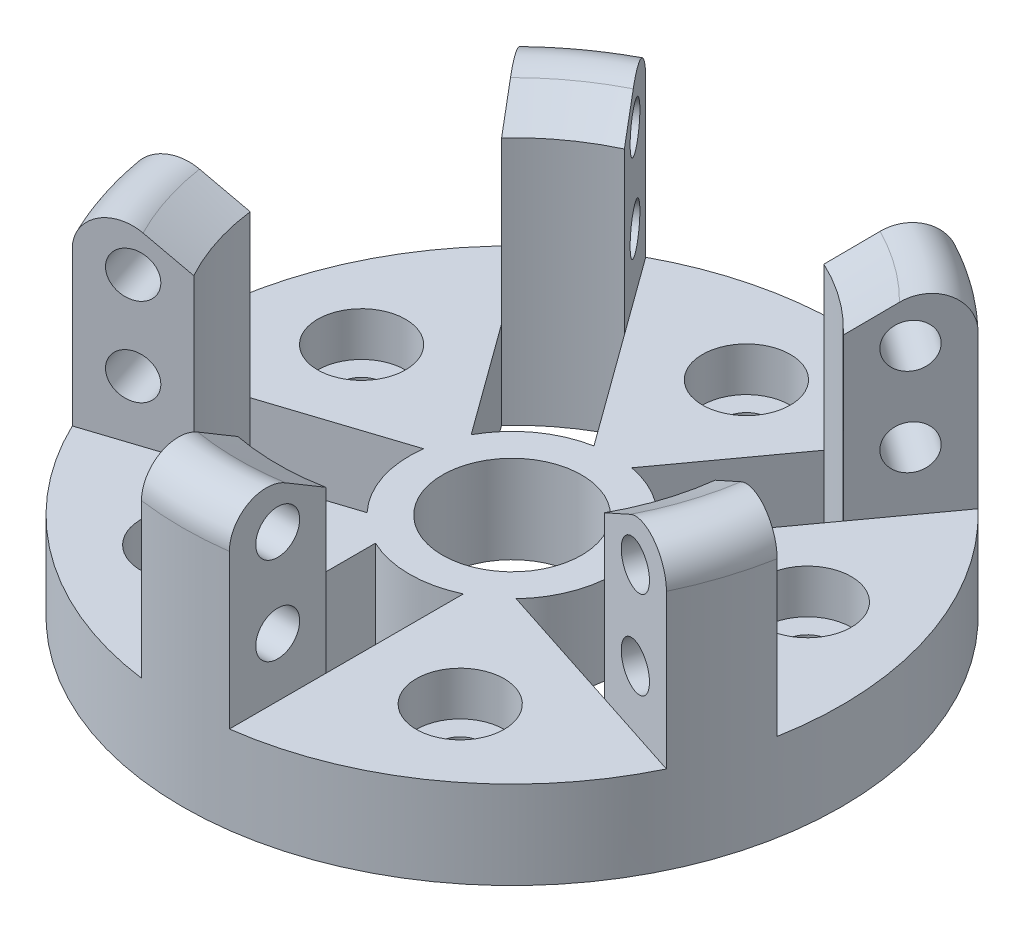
from build123d import *

# Parameters (mm, degrees)
CUT_EXTRUDE_2_DEPTH      = 69.745909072
CUT_EXTRUDE_START        = 12
SKETCH_3_R               = 6
CUT_EXTRUDE_3_DEPTH      = 6
SKETCH_3_3_R             = 3
CUT_EXTRUDE_4_DEPTH      = 87.121521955
PATTERN_CIRCULAR_1_COUNT = 5
SKETCH_4_R               = 9.5
CUT_EXTRUDE_5_DEPTH      = 69.745909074
CUT_EXTRUDE_6_DEPTH      = 69.745909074
PATTERN_CIRCULAR_2_COUNT = 5
SKETCH_5_R               = 3
CUT_EXTRUDE_7_DEPTH      = 80.273408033
PATTERN_CIRCULAR_3_COUNT = 5


with BuildPart() as part:
    # Sketch 1 → Revolve 1 (revolve)
    with BuildSketch(Plane.XY, mode=Mode.PRIVATE) as revolve_1_sk:
        with BuildLine():
            Line((-37.409581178, 37.276649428), (-32, 34))
            Line((-32, 34), (-32, 12))
            Line((-32, 12), (0, 12))
            Line((0, 12), (0, 0))
            Line((0, 0), (-45, 0))
            Line((-45, 0), (-45, 12))
            Line((-45, 12), (-45, 33))
            ThreePointArc((-45, 33), (-42.454374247, 37.356150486), (-37.409581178, 37.276649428))
        make_face()
    revolve(revolve_1_sk.sketch.rotate(Axis((0, -43.014705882, 0), (0, 1, 0)), 270), axis=Axis((0, -43.014705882, 0), (0, 1, 0)))

    # Sketch 2 → Cut-Extrude 2 (cut, through all)
    with BuildSketch(Plane(origin=(0, 12, 0), x_dir=(1, 0, 0), z_dir=(0, 1, 0))):
        with BuildLine():
            Line((6, -12.649110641), (6, -44.598206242))
            ThreePointArc((6, -44.598206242), (26.450336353, -36.405764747), (40.561312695, -19.487942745))
            Line((40.561312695, -19.487942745), (10.175917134, -9.615129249))
            ThreePointArc((10.175917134, -9.615129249), (8.228993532, -11.326237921), (6, -12.649110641))
        make_face()
        with BuildLine():
            Line((-10.175917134, -9.615129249), (-40.561312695, -19.487942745))
            ThreePointArc((-40.561312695, -19.487942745), (-26.450336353, -36.405764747), (-6, -44.598206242))
            Line((-6, -44.598206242), (-6, -12.649110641))
            ThreePointArc((-6, -12.649110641), (-8.228993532, -11.326237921), (-10.175917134, -9.615129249))
        make_face()
        with BuildLine():
            Line((-12.289062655, 6.706633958), (-31.068269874, 32.553995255))
            ThreePointArc((-31.068269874, 32.553995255), (-42.797543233, 13.905764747), (-44.269516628, -8.07526455))
            Line((-44.269516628, -8.07526455), (-13.884121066, 1.797548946))
            ThreePointArc((-13.884121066, 1.797548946), (-13.314791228, 4.326237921), (-12.289062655, 6.706633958))
        make_face()
        with BuildLine():
            Line((2.580858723, 13.760056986), (21.360065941, 39.607418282))
            ThreePointArc((21.360065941, 39.607418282), (0, 45), (-21.360065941, 39.607418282))
            Line((-21.360065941, 39.607418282), (-2.580858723, 13.760056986))
            ThreePointArc((-2.580858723, 13.760056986), (0, 14), (2.580858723, 13.760056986))
        make_face()
        with BuildLine():
            Line((13.884121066, 1.797548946), (44.269516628, -8.07526455))
            ThreePointArc((44.269516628, -8.07526455), (42.797543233, 13.905764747), (31.068269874, 32.553995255))
            Line((31.068269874, 32.553995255), (12.289062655, 6.706633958))
            ThreePointArc((12.289062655, 6.706633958), (13.314791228, 4.326237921), (13.884121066, 1.797548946))
        make_face()
    extrude(amount=CUT_EXTRUDE_2_DEPTH, mode=Mode.SUBTRACT)

    # Sketch 3 → Cut-Extrude 3 (cut)
    with BuildSketch(Plane(origin=(0, 0, 0), x_dir=(1, 0, 0), z_dir=(0, 1, 0)).offset(CUT_EXTRUDE_START)):
        with Locations(Location((0, 32, 0), (0, 0, 90))):
            Circle(SKETCH_3_R)
    cut_extrude_3 = extrude(amount=-CUT_EXTRUDE_3_DEPTH, mode=Mode.SUBTRACT)

    # Sketch 3_3 → Cut-Extrude 4 (cut, through all)
    with BuildSketch(Plane(origin=(0, 0, 0), x_dir=(1, 0, 0), z_dir=(0, 1, 0)).offset(CUT_EXTRUDE_START)):
        with Locations(Location((0, 32, 0), (0, 0, 90))):
            Circle(SKETCH_3_3_R)
    cut_extrude_4 = extrude(amount=-CUT_EXTRUDE_4_DEPTH, mode=Mode.SUBTRACT)

    # Pattern Circular 1: Cut-Extrude 3, Cut-Extrude 4 ×5 about axis
    pattern_circular_1_axis = Axis((0, 0, 0), (0, 1, 0))
    add([cut_extrude_3.rotate(pattern_circular_1_axis, i * 360 / PATTERN_CIRCULAR_1_COUNT) for i in range(1, PATTERN_CIRCULAR_1_COUNT)], mode=Mode.SUBTRACT)
    add([cut_extrude_4.rotate(pattern_circular_1_axis, i * 360 / PATTERN_CIRCULAR_1_COUNT) for i in range(1, PATTERN_CIRCULAR_1_COUNT)], mode=Mode.SUBTRACT)

    # Sketch 4 → Cut-Extrude 5 (cut, through all)
    with BuildSketch(Plane(origin=(0, 12, 0), x_dir=(1, 0, 0), z_dir=(0, 1, 0))):
        with Locations(Location((0, 0, 0), (0, 0, 270))):
            Circle(SKETCH_4_R)
    extrude(amount=-CUT_EXTRUDE_5_DEPTH, mode=Mode.SUBTRACT)

    # Sketch 4_3 → Cut-Extrude 6 (cut, through all)
    with BuildSketch(Plane(origin=(0, 12, 0), x_dir=(1, 0, 0), z_dir=(0, 1, 0))):
        with BuildLine():
            Line((-6, -12.649110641), (-6, -31.432467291))
            ThreePointArc((-6, -31.432467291), (0, -32), (6, -31.432467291))
            Line((6, -31.432467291), (6, -12.649110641))
            ThreePointArc((6, -12.649110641), (0, -14), (-6, -12.649110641))
        make_face()
    cut_extrude_6 = extrude(amount=-CUT_EXTRUDE_6_DEPTH, mode=Mode.SUBTRACT)

    # Pattern Circular 2: Cut-Extrude 6 ×5 about axis
    pattern_circular_2_axis = Axis((0, 0, 0), (0, 1, 0))
    for i in range(1, PATTERN_CIRCULAR_2_COUNT):
        add(cut_extrude_6.rotate(pattern_circular_2_axis, i * 360 / PATTERN_CIRCULAR_2_COUNT), mode=Mode.SUBTRACT)

    # Sketch 5 → Cut-Extrude 7 (cut, symmetric)
    with BuildSketch(Plane(origin=(-4.854101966, 0, 3.526711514), x_dir=(0.5877852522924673, 0, 0.8090169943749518), z_dir=(-0.8090169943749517, 0, 0.5877852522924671))):
        with Locations((-38, 32)):
            Circle(SKETCH_5_R)
        with Locations((-38, 20)):
            Circle(SKETCH_5_R)
    cut_extrude_7 = extrude(amount=CUT_EXTRUDE_7_DEPTH, both=True, mode=Mode.SUBTRACT)

    # Pattern Circular 3: Cut-Extrude 7 ×5 about axis
    pattern_circular_3_axis = Axis((0, 0, 0), (0, -1, 0))
    for i in range(1, PATTERN_CIRCULAR_3_COUNT):
        add(cut_extrude_7.rotate(pattern_circular_3_axis, i * 360 / PATTERN_CIRCULAR_3_COUNT), mode=Mode.SUBTRACT)


solid = part.part
